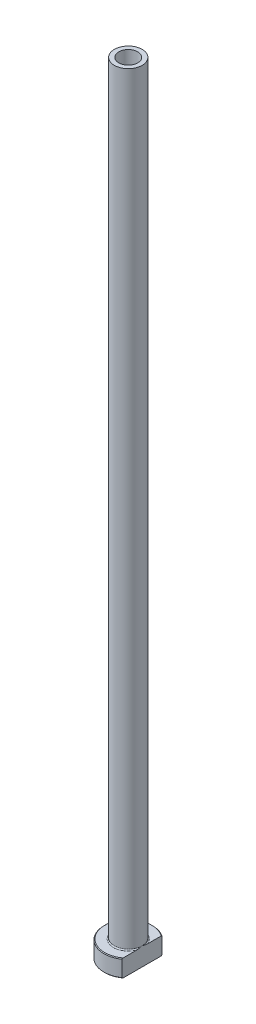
ISO-10303-21;
HEADER;
FILE_DESCRIPTION(('STEP AP214'),'2;1');
FILE_NAME('part.step','',(''),(''),'','','');
FILE_SCHEMA(('AUTOMOTIVE_DESIGN { 1 0 10303 214 1 1 1 1 }'));
ENDSEC;
DATA;
#1=APPLICATION_CONTEXT('core data for automotive mechanical design processes');
#2=APPLICATION_PROTOCOL_DEFINITION('international standard','automotive_design',2000,#1);
#3=PRODUCT_CONTEXT('',#1,'mechanical');
#4=PRODUCT('Part','Part','',(#3));
#5=PRODUCT_RELATED_PRODUCT_CATEGORY('part','',(#4));
#6=PRODUCT_DEFINITION_FORMATION('','',#4);
#7=PRODUCT_DEFINITION_CONTEXT('part definition',#1,'design');
#8=PRODUCT_DEFINITION('design','',#6,#7);
#9=PRODUCT_DEFINITION_SHAPE('','',#8);
#10=(LENGTH_UNIT() NAMED_UNIT(*) SI_UNIT(.MILLI.,.METRE.));
#11=(NAMED_UNIT(*) PLANE_ANGLE_UNIT() SI_UNIT($,.RADIAN.));
#12=(NAMED_UNIT(*) SI_UNIT($,.STERADIAN.) SOLID_ANGLE_UNIT());
#13=UNCERTAINTY_MEASURE_WITH_UNIT(LENGTH_MEASURE(1.E-05),#10,'distance_accuracy_value','');
#14=(GEOMETRIC_REPRESENTATION_CONTEXT(3) GLOBAL_UNCERTAINTY_ASSIGNED_CONTEXT((#13)) GLOBAL_UNIT_ASSIGNED_CONTEXT((#10,
#11,#12)) REPRESENTATION_CONTEXT('',''));
#15=CARTESIAN_POINT('',(0.,0.,0.));
#16=DIRECTION('',(0.,0.,1.));
#17=DIRECTION('',(1.,0.,0.));
#18=AXIS2_PLACEMENT_3D('',#15,#16,#17);
#19=CARTESIAN_POINT('',(0.,92.1876809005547,0.));
#20=DIRECTION('',(0.,1.,0.));
#21=DIRECTION('',(0.,0.,1.));
#22=AXIS2_PLACEMENT_3D('',#19,#20,#21);
#23=CYLINDRICAL_SURFACE('',#22,2.75000000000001);
#24=CARTESIAN_POINT('',(0.,225.,0.));
#25=DIRECTION('',(0.,1.,0.));
#26=DIRECTION('',(0.,0.,1.));
#27=AXIS2_PLACEMENT_3D('',#24,#25,#26);
#28=CIRCLE('',#27,2.75000000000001);
#29=CARTESIAN_POINT('',(0.,225.,2.75000000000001));
#30=VERTEX_POINT('',#29);
#31=EDGE_CURVE('E167',#30,#30,#28,.T.);
#32=ORIENTED_EDGE('',*,*,#31,.T.);
#33=EDGE_LOOP('',(#32));
#34=FACE_BOUND('',#33,.T.);
#35=CARTESIAN_POINT('',(0.,180.,0.));
#36=DIRECTION('',(0.,1.,0.));
#37=DIRECTION('',(0.,0.,1.));
#38=AXIS2_PLACEMENT_3D('',#35,#36,#37);
#39=CIRCLE('',#38,2.75000000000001);
#40=CARTESIAN_POINT('',(0.,180.,2.75000000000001));
#41=VERTEX_POINT('',#40);
#42=EDGE_CURVE('E170',#41,#41,#39,.T.);
#43=ORIENTED_EDGE('',*,*,#42,.F.);
#44=EDGE_LOOP('',(#43));
#45=FACE_BOUND('',#44,.T.);
#46=ADVANCED_FACE('F32',(#34,#45),#23,.F.);
#47=CARTESIAN_POINT('',(-2.75000000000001,225.,0.));
#48=DIRECTION('',(0.,1.,0.));
#49=DIRECTION('',(0.,0.,1.));
#50=AXIS2_PLACEMENT_3D('',#47,#48,#49);
#51=PLANE('',#50);
#52=CARTESIAN_POINT('',(0.,225.,0.));
#53=DIRECTION('',(0.,1.,0.));
#54=DIRECTION('',(0.,0.,1.));
#55=AXIS2_PLACEMENT_3D('',#52,#53,#54);
#56=CIRCLE('',#55,4.00000000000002);
#57=CARTESIAN_POINT('',(0.,225.,4.00000000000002));
#58=VERTEX_POINT('',#57);
#59=EDGE_CURVE('E174',#58,#58,#56,.T.);
#60=ORIENTED_EDGE('',*,*,#59,.T.);
#61=EDGE_LOOP('',(#60));
#62=FACE_BOUND('',#61,.T.);
#63=ORIENTED_EDGE('',*,*,#31,.F.);
#64=EDGE_LOOP('',(#63));
#65=FACE_BOUND('',#64,.T.);
#66=ADVANCED_FACE('F157',(#62,#65),#51,.T.);
#67=CARTESIAN_POINT('',(0.,92.1876809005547,0.));
#68=DIRECTION('',(0.,1.,0.));
#69=DIRECTION('',(0.,0.,1.));
#70=AXIS2_PLACEMENT_3D('',#67,#68,#69);
#71=CYLINDRICAL_SURFACE('',#70,4.);
#72=CARTESIAN_POINT('',(0.,5.3,0.));
#73=DIRECTION('',(0.,1.,0.));
#74=DIRECTION('',(0.,0.,1.));
#75=AXIS2_PLACEMENT_3D('',#72,#73,#74);
#76=CIRCLE('',#75,4.);
#77=CARTESIAN_POINT('',(4.,5.3,0.));
#78=VERTEX_POINT('',#77);
#79=EDGE_CURVE('E180',#78,#78,#76,.T.);
#80=ORIENTED_EDGE('',*,*,#79,.T.);
#81=EDGE_LOOP('',(#80));
#82=FACE_BOUND('',#81,.T.);
#83=ORIENTED_EDGE('',*,*,#59,.F.);
#84=EDGE_LOOP('',(#83));
#85=FACE_BOUND('',#84,.T.);
#86=ADVANCED_FACE('F162',(#82,#85),#71,.T.);
#87=CARTESIAN_POINT('',(-3.99999999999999,5.,0.));
#88=DIRECTION('',(0.,1.,0.));
#89=DIRECTION('',(0.,0.,1.));
#90=AXIS2_PLACEMENT_3D('',#87,#88,#89);
#91=PLANE('',#90);
#92=DIRECTION('',(0.,0.,1.));
#93=VECTOR('',#92,1.);
#94=CARTESIAN_POINT('',(4.,5.,0.));
#95=LINE('',#94,#93);
#96=CARTESIAN_POINT('',(4.,5.,-5.49909083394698));
#97=VERTEX_POINT('',#96);
#98=CARTESIAN_POINT('',(4.,5.,-1.57797338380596));
#99=VERTEX_POINT('',#98);
#100=EDGE_CURVE('E54',#97,#99,#95,.T.);
#101=ORIENTED_EDGE('',*,*,#100,.F.);
#102=CARTESIAN_POINT('',(0.,5.,0.));
#103=DIRECTION('',(0.,1.,0.));
#104=DIRECTION('',(0.,0.,1.));
#105=AXIS2_PLACEMENT_3D('',#102,#103,#104);
#106=CIRCLE('',#105,6.79999999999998);
#107=CARTESIAN_POINT('',(3.99999999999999,5.,5.49909083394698));
#108=VERTEX_POINT('',#107);
#109=EDGE_CURVE('E186',#97,#108,#106,.T.);
#110=ORIENTED_EDGE('',*,*,#109,.T.);
#111=CARTESIAN_POINT('',(4.,5.,1.57797338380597));
#112=VERTEX_POINT('',#111);
#113=EDGE_CURVE('E134',#112,#108,#95,.T.);
#114=ORIENTED_EDGE('',*,*,#113,.F.);
#115=CARTESIAN_POINT('',(0.,5.,0.));
#116=DIRECTION('',(0.,1.,0.));
#117=DIRECTION('',(0.,0.,1.));
#118=AXIS2_PLACEMENT_3D('',#115,#116,#117);
#119=CIRCLE('',#118,4.3);
#120=EDGE_CURVE('E183',#112,#99,#119,.F.);
#121=ORIENTED_EDGE('',*,*,#120,.T.);
#122=EDGE_LOOP('',(#101,#110,#114,#121));
#123=FACE_BOUND('',#122,.T.);
#124=ADVANCED_FACE('F197',(#123),#91,.T.);
#125=CARTESIAN_POINT('',(0.,92.1876809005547,0.));
#126=DIRECTION('',(0.,1.,0.));
#127=DIRECTION('',(0.,0.,1.));
#128=AXIS2_PLACEMENT_3D('',#125,#126,#127);
#129=CYLINDRICAL_SURFACE('',#128,6.99999999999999);
#130=DIRECTION('',(0.,-1.,0.));
#131=VECTOR('',#130,1.);
#132=CARTESIAN_POINT('',(3.99999999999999,225.,5.74456264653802));
#133=LINE('',#132,#131);
#134=CARTESIAN_POINT('',(3.99999999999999,4.79999999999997,5.74456264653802));
#135=VERTEX_POINT('',#134);
#136=CARTESIAN_POINT('',(3.99999999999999,0.20000000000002,5.74456264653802));
#137=VERTEX_POINT('',#136);
#138=EDGE_CURVE('E82',#135,#137,#133,.T.);
#139=ORIENTED_EDGE('',*,*,#138,.F.);
#140=CARTESIAN_POINT('',(0.,4.79999999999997,0.));
#141=DIRECTION('',(0.,1.,0.));
#142=DIRECTION('',(0.,0.,1.));
#143=AXIS2_PLACEMENT_3D('',#140,#141,#142);
#144=CIRCLE('',#143,6.99999999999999);
#145=CARTESIAN_POINT('',(4.,4.79999999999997,-5.74456264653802));
#146=VERTEX_POINT('',#145);
#147=EDGE_CURVE('E95',#135,#146,#144,.F.);
#148=ORIENTED_EDGE('',*,*,#147,.T.);
#149=DIRECTION('',(0.,-1.,0.));
#150=VECTOR('',#149,1.);
#151=CARTESIAN_POINT('',(4.,225.,-5.74456264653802));
#152=LINE('',#151,#150);
#153=CARTESIAN_POINT('',(4.,0.20000000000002,-5.74456264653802));
#154=VERTEX_POINT('',#153);
#155=EDGE_CURVE('E192',#146,#154,#152,.T.);
#156=ORIENTED_EDGE('',*,*,#155,.T.);
#157=CARTESIAN_POINT('',(0.,0.20000000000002,0.));
#158=DIRECTION('',(0.,-1.,0.));
#159=DIRECTION('',(0.,0.,-1.));
#160=AXIS2_PLACEMENT_3D('',#157,#158,#159);
#161=CIRCLE('',#160,6.99999999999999);
#162=EDGE_CURVE('E98',#154,#137,#161,.F.);
#163=ORIENTED_EDGE('',*,*,#162,.T.);
#164=EDGE_LOOP('',(#139,#148,#156,#163));
#165=FACE_BOUND('',#164,.T.);
#166=ADVANCED_FACE('F190',(#165),#129,.T.);
#167=CARTESIAN_POINT('',(-6.99999999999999,0.,0.));
#168=DIRECTION('',(0.,-1.,0.));
#169=DIRECTION('',(0.,0.,-1.));
#170=AXIS2_PLACEMENT_3D('',#167,#168,#169);
#171=PLANE('',#170);
#172=CARTESIAN_POINT('',(0.,0.,0.));
#173=DIRECTION('',(0.,-1.,0.));
#174=DIRECTION('',(0.,0.,-1.));
#175=AXIS2_PLACEMENT_3D('',#172,#173,#174);
#176=CIRCLE('',#175,3.50000000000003);
#177=CARTESIAN_POINT('',(0.,0.,-3.50000000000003));
#178=VERTEX_POINT('',#177);
#179=EDGE_CURVE('E40',#178,#178,#176,.F.);
#180=ORIENTED_EDGE('',*,*,#179,.T.);
#181=EDGE_LOOP('',(#180));
#182=FACE_BOUND('',#181,.T.);
#183=DIRECTION('',(0.,0.,-1.));
#184=VECTOR('',#183,1.);
#185=CARTESIAN_POINT('',(3.99999999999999,0.,5.74456264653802));
#186=LINE('',#185,#184);
#187=CARTESIAN_POINT('',(3.99999999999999,0.,5.49909083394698));
#188=VERTEX_POINT('',#187);
#189=CARTESIAN_POINT('',(4.,0.,-5.49909083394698));
#190=VERTEX_POINT('',#189);
#191=EDGE_CURVE('E47',#188,#190,#186,.T.);
#192=ORIENTED_EDGE('',*,*,#191,.F.);
#193=CARTESIAN_POINT('',(0.,0.,0.));
#194=DIRECTION('',(0.,-1.,0.));
#195=DIRECTION('',(0.,0.,-1.));
#196=AXIS2_PLACEMENT_3D('',#193,#194,#195);
#197=CIRCLE('',#196,6.79999999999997);
#198=EDGE_CURVE('E92',#188,#190,#197,.T.);
#199=ORIENTED_EDGE('',*,*,#198,.T.);
#200=EDGE_LOOP('',(#192,#199));
#201=FACE_BOUND('',#200,.T.);
#202=ADVANCED_FACE('F91',(#182,#201),#171,.T.);
#203=CARTESIAN_POINT('',(0.,92.1876809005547,0.));
#204=DIRECTION('',(0.,1.,0.));
#205=DIRECTION('',(0.,0.,1.));
#206=AXIS2_PLACEMENT_3D('',#203,#204,#205);
#207=CYLINDRICAL_SURFACE('',#206,3.);
#208=CARTESIAN_POINT('',(0.,0.500000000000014,0.));
#209=DIRECTION('',(0.,-1.,0.));
#210=DIRECTION('',(0.,0.,-1.));
#211=AXIS2_PLACEMENT_3D('',#208,#209,#210);
#212=CIRCLE('',#211,3.);
#213=CARTESIAN_POINT('',(0.,0.500000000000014,-3.));
#214=VERTEX_POINT('',#213);
#215=EDGE_CURVE('E11',#214,#214,#212,.T.);
#216=ORIENTED_EDGE('',*,*,#215,.T.);
#217=EDGE_LOOP('',(#216));
#218=FACE_BOUND('',#217,.T.);
#219=CARTESIAN_POINT('',(0.,168.,0.));
#220=DIRECTION('',(0.,1.,0.));
#221=DIRECTION('',(0.,0.,1.));
#222=AXIS2_PLACEMENT_3D('',#219,#220,#221);
#223=CIRCLE('',#222,3.00000000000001);
#224=CARTESIAN_POINT('',(0.,168.,3.00000000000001));
#225=VERTEX_POINT('',#224);
#226=EDGE_CURVE('E172',#225,#225,#223,.T.);
#227=ORIENTED_EDGE('',*,*,#226,.T.);
#228=EDGE_LOOP('',(#227));
#229=FACE_BOUND('',#228,.T.);
#230=ADVANCED_FACE('F215',(#218,#229),#207,.F.);
#231=CARTESIAN_POINT('',(0.,168.,0.));
#232=DIRECTION('',(0.,-1.,0.));
#233=DIRECTION('',(0.,0.,-1.));
#234=AXIS2_PLACEMENT_3D('',#231,#232,#233);
#235=CONICAL_SURFACE('',#234,3.00000000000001,0.0208303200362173);
#236=ORIENTED_EDGE('',*,*,#42,.T.);
#237=EDGE_LOOP('',(#236));
#238=FACE_BOUND('',#237,.T.);
#239=ORIENTED_EDGE('',*,*,#226,.F.);
#240=EDGE_LOOP('',(#239));
#241=FACE_BOUND('',#240,.T.);
#242=ADVANCED_FACE('F111',(#238,#241),#235,.F.);
#243=CARTESIAN_POINT('',(0.,5.3,0.));
#244=DIRECTION('',(0.,1.,0.));
#245=DIRECTION('',(0.,0.,1.));
#246=AXIS2_PLACEMENT_3D('',#243,#244,#245);
#247=TOROIDAL_SURFACE('',#246,4.3,0.3);
#248=ORIENTED_EDGE('',*,*,#120,.F.);
#249=CARTESIAN_POINT('',(4.,5.3,0.));
#250=CARTESIAN_POINT('',(4.,5.3000006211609,-1.06261402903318E-10));
#251=CARTESIAN_POINT('',(4.,5.30000124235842,2.17726115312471E-07));
#252=CARTESIAN_POINT('',(4.,5.30000240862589,8.3614111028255E-07));
#253=CARTESIAN_POINT('',(4.,5.30000294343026,1.25011693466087E-06));
#254=CARTESIAN_POINT('',(4.,5.30000404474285,2.23959355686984E-06));
#255=CARTESIAN_POINT('',(4.,5.30000459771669,2.83084484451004E-06));
#256=CARTESIAN_POINT('',(4.,5.30000559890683,4.06516628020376E-06));
#257=CARTESIAN_POINT('',(4.,5.30000604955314,4.70640106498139E-06));
#258=CARTESIAN_POINT('',(4.,5.30000769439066,7.15677247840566E-06));
#259=CARTESIAN_POINT('',(4.,5.30000879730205,9.02996026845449E-06));
#260=CARTESIAN_POINT('',(4.,5.30001063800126,1.27664892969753E-05));
#261=CARTESIAN_POINT('',(4.,5.30001139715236,1.46197811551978E-05));
#262=CARTESIAN_POINT('',(4.,5.30001453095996,2.23679231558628E-05));
#263=CARTESIAN_POINT('',(4.,5.30001683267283,2.829687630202E-05));
#264=CARTESIAN_POINT('',(4.,5.30002027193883,3.95668745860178E-05));
#265=CARTESIAN_POINT('',(4.,5.30002152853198,4.487154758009E-05));
#266=CARTESIAN_POINT('',(4.,5.3000306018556,8.40118223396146E-05));
#267=CARTESIAN_POINT('',(4.,5.30003739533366,0.00011802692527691));
#268=CARTESIAN_POINT('',(3.99999999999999,5.30006713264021,0.000252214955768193));
#269=CARTESIAN_POINT('',(3.99999999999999,5.30009559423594,0.000351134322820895));
#270=CARTESIAN_POINT('',(4.,5.30020622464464,0.000742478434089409));
#271=CARTESIAN_POINT('',(4.,5.30028475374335,0.00103561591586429));
#272=CARTESIAN_POINT('',(3.99999999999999,5.30059889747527,0.00219920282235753));
#273=CARTESIAN_POINT('',(3.99999999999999,5.30083905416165,0.00306873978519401));
#274=CARTESIAN_POINT('',(4.,5.30183682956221,0.00669141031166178));
#275=CARTESIAN_POINT('',(4.,5.30258877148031,0.0094456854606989));
#276=CARTESIAN_POINT('',(3.99999999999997,5.31066890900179,0.0390293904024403));
#277=CARTESIAN_POINT('',(3.99999999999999,5.31802631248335,0.0658531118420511));
#278=CARTESIAN_POINT('',(4.,5.33239676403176,0.11844192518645));
#279=CARTESIAN_POINT('',(4.,5.33941183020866,0.144206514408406));
#280=CARTESIAN_POINT('',(3.99999999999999,5.35427366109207,0.199017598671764));
#281=CARTESIAN_POINT('',(3.99999999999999,5.362113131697,0.228066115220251));
#282=CARTESIAN_POINT('',(4.,5.37776349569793,0.286511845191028));
#283=CARTESIAN_POINT('',(4.,5.38557313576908,0.31590939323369));
#284=CARTESIAN_POINT('',(4.,5.40425662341,0.386994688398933));
#285=CARTESIAN_POINT('',(4.,5.4150523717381,0.4287031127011));
#286=CARTESIAN_POINT('',(4.,5.43592310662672,0.511098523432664));
#287=CARTESIAN_POINT('',(4.,5.44600969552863,0.551782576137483));
#288=CARTESIAN_POINT('',(4.,5.47850986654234,0.686599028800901));
#289=CARTESIAN_POINT('',(4.,5.49978370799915,0.781011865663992));
#290=CARTESIAN_POINT('',(4.,5.53807543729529,0.971847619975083));
#291=CARTESIAN_POINT('',(4.,5.55504273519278,1.06828120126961));
#292=CARTESIAN_POINT('',(4.,5.57582405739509,1.21752725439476));
#293=CARTESIAN_POINT('',(4.,5.5820979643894,1.26999379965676));
#294=CARTESIAN_POINT('',(4.,5.59210686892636,1.37516324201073));
#295=CARTESIAN_POINT('',(4.,5.59584265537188,1.42786606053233));
#296=CARTESIAN_POINT('',(4.,5.60010438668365,1.53310673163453));
#297=CARTESIAN_POINT('',(4.,5.6006487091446,1.58564378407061));
#298=CARTESIAN_POINT('',(4.,5.59767158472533,1.69058605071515));
#299=CARTESIAN_POINT('',(4.,5.59415502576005,1.74299134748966));
#300=CARTESIAN_POINT('',(4.,5.58503062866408,1.81903290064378));
#301=CARTESIAN_POINT('',(4.,5.58157617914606,1.84292934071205));
#302=CARTESIAN_POINT('',(4.,5.57329952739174,1.89051061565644));
#303=CARTESIAN_POINT('',(4.,5.56847619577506,1.91419525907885));
#304=CARTESIAN_POINT('',(4.,5.55726644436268,1.96092888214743));
#305=CARTESIAN_POINT('',(4.,5.55089740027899,1.98398195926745));
#306=CARTESIAN_POINT('',(4.,5.53623434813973,2.02945550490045));
#307=CARTESIAN_POINT('',(4.,5.52794253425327,2.05187666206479));
#308=CARTESIAN_POINT('',(4.,5.50887098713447,2.09590631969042));
#309=CARTESIAN_POINT('',(4.,5.49806837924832,2.11750508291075));
#310=CARTESIAN_POINT('',(4.,5.47333401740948,2.15885583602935));
#311=CARTESIAN_POINT('',(4.,5.45941272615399,2.17861369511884));
#312=CARTESIAN_POINT('',(4.,5.43588221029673,2.20522942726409));
#313=CARTESIAN_POINT('',(4.,5.42781139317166,2.21344043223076));
#314=CARTESIAN_POINT('',(4.,5.41065114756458,2.22875149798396));
#315=CARTESIAN_POINT('',(4.,5.4015612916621,2.23585108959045));
#316=CARTESIAN_POINT('',(4.,5.38220524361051,2.24859694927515));
#317=CARTESIAN_POINT('',(4.,5.37192420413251,2.25422119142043));
#318=CARTESIAN_POINT('',(4.,5.3504507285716,2.26331064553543));
#319=CARTESIAN_POINT('',(4.,5.33926122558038,2.26678251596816));
#320=CARTESIAN_POINT('',(4.,5.31952044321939,2.2705126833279));
#321=CARTESIAN_POINT('',(4.,5.31108453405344,2.27139016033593));
#322=CARTESIAN_POINT('',(4.,5.29418624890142,2.27168963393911));
#323=CARTESIAN_POINT('',(4.,5.2857238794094,2.27111196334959));
#324=CARTESIAN_POINT('',(4.,5.269041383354,2.26855580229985));
#325=CARTESIAN_POINT('',(4.,5.26082066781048,2.26658107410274));
#326=CARTESIAN_POINT('',(4.,5.24478214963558,2.26139496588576));
#327=CARTESIAN_POINT('',(4.,5.23696461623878,2.25818277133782));
#328=CARTESIAN_POINT('',(4.,5.2185123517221,2.24908332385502));
#329=CARTESIAN_POINT('',(4.,5.20815219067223,2.24264095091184));
#330=CARTESIAN_POINT('',(4.,5.18857975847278,2.22819957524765));
#331=CARTESIAN_POINT('',(4.,5.17937061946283,2.22019647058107));
#332=CARTESIAN_POINT('',(4.,5.15665383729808,2.19777756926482));
#333=CARTESIAN_POINT('',(4.,5.14403484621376,2.18246908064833));
#334=CARTESIAN_POINT('',(4.,5.12118369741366,2.15020843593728));
#335=CARTESIAN_POINT('',(4.,5.11095480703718,2.13325407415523));
#336=CARTESIAN_POINT('',(4.,5.09273574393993,2.09892324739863));
#337=CARTESIAN_POINT('',(4.,5.08468212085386,2.0815798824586));
#338=CARTESIAN_POINT('',(4.,5.07005901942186,2.04627072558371));
#339=CARTESIAN_POINT('',(4.,5.06349101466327,2.02830433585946));
#340=CARTESIAN_POINT('',(4.,5.04555485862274,1.97350761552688));
#341=CARTESIAN_POINT('',(4.,5.0360897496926,1.93605770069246));
#342=CARTESIAN_POINT('',(4.,5.01780569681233,1.84529235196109));
#343=CARTESIAN_POINT('',(4.,5.01077018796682,1.79164082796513));
#344=CARTESIAN_POINT('',(4.,5.00182846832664,1.68379947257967));
#345=CARTESIAN_POINT('',(4.,4.99993887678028,1.62960846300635));
#346=CARTESIAN_POINT('',(4.,5.00006129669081,1.52361204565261));
#347=CARTESIAN_POINT('',(4.,5.00190698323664,1.47180551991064));
#348=CARTESIAN_POINT('',(4.,5.00841243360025,1.36835357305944));
#349=CARTESIAN_POINT('',(4.,5.01307376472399,1.31670825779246));
#350=CARTESIAN_POINT('',(4.,5.02905484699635,1.17431887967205));
#351=CARTESIAN_POINT('',(4.,5.04274090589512,1.08384207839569));
#352=CARTESIAN_POINT('',(4.,5.06701714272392,0.947757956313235));
#353=CARTESIAN_POINT('',(4.,5.07585573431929,0.901814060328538));
#354=CARTESIAN_POINT('',(4.,5.09458665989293,0.810008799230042));
#355=CARTESIAN_POINT('',(4.,5.1044818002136,0.76414800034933));
#356=CARTESIAN_POINT('',(4.,5.12892434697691,0.655631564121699));
#357=CARTESIAN_POINT('',(4.,5.14383556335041,0.593058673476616));
#358=CARTESIAN_POINT('',(3.99999999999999,5.17458762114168,0.468885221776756));
#359=CARTESIAN_POINT('',(3.99999999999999,5.19041623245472,0.407281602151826));
#360=CARTESIAN_POINT('',(4.,5.22090834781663,0.291232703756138));
#361=CARTESIAN_POINT('',(4.00000000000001,5.23550024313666,0.236768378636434));
#362=CARTESIAN_POINT('',(3.99999999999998,5.26562550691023,0.125604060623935));
#363=CARTESIAN_POINT('',(3.99999999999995,5.28117250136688,0.0689076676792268));
#364=CARTESIAN_POINT('',(4.,5.29741226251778,0.00944154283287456));
#365=CARTESIAN_POINT('',(4.,5.29816540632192,0.00668315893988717));
#366=CARTESIAN_POINT('',(3.99999999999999,5.29916346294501,0.00305954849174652));
#367=CARTESIAN_POINT('',(3.99999999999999,5.29940273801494,0.00219318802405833));
#368=CARTESIAN_POINT('',(4.,5.29971580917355,0.00103357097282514));
#369=CARTESIAN_POINT('',(4.,5.29979412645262,0.000741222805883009));
#370=CARTESIAN_POINT('',(3.99999999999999,5.29990450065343,0.000350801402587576));
#371=CARTESIAN_POINT('',(3.99999999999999,5.29993292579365,0.000252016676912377));
#372=CARTESIAN_POINT('',(4.,5.29996263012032,0.000117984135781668));
#373=CARTESIAN_POINT('',(4.,5.29996941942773,8.39881915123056E-05));
#374=CARTESIAN_POINT('',(4.,5.29997848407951,4.48674025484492E-05));
#375=CARTESIAN_POINT('',(4.,5.29997973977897,3.95638200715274E-05));
#376=CARTESIAN_POINT('',(4.,5.2999831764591,2.82960347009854E-05));
#377=CARTESIAN_POINT('',(4.,5.29998547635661,2.23681462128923E-05));
#378=CARTESIAN_POINT('',(4.,5.29998860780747,1.46211004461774E-05));
#379=CARTESIAN_POINT('',(4.,5.29998936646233,1.27678902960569E-05));
#380=CARTESIAN_POINT('',(4.,5.29999120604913,9.03144078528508E-06));
#381=CARTESIAN_POINT('',(4.,5.29999230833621,7.15824106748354E-06));
#382=CARTESIAN_POINT('',(4.,5.29999395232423,4.70775534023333E-06));
#383=CARTESIAN_POINT('',(4.,5.29999440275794,4.06646398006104E-06));
#384=CARTESIAN_POINT('',(4.,5.29999540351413,2.8319910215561E-06));
#385=CARTESIAN_POINT('',(4.,5.29999595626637,2.24064356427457E-06));
#386=CARTESIAN_POINT('',(4.,5.29999705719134,1.25093982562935E-06));
#387=CARTESIAN_POINT('',(4.,5.29999759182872,8.36841164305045E-07));
#388=CARTESIAN_POINT('',(4.,5.29999875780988,2.18117796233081E-07));
#389=CARTESIAN_POINT('',(4.,5.29999937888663,1.06254479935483E-10));
#390=CARTESIAN_POINT('',(4.,5.3,0.));
#391=B_SPLINE_CURVE_WITH_KNOTS('',3,(#249,#250,#251,#252,#253,#254,#255,#256,#257,#258,#259,
#260,#261,#262,#263,#264,#265,#266,#267,#268,#269,#270,#271,#272,#273,#274,#275,#276,#277,#278,
#279,#280,#281,#282,#283,#284,#285,#286,#287,#288,#289,#290,#291,#292,#293,#294,#295,#296,#297,
#298,#299,#300,#301,#302,#303,#304,#305,#306,#307,#308,#309,#310,#311,#312,#313,#314,#315,#316,
#317,#318,#319,#320,#321,#322,#323,#324,#325,#326,#327,#328,#329,#330,#331,#332,#333,#334,#335,
#336,#337,#338,#339,#340,#341,#342,#343,#344,#345,#346,#347,#348,#349,#350,#351,#352,#353,#354,
#355,#356,#357,#358,#359,#360,#361,#362,#363,#364,#365,#366,#367,#368,#369,#370,#371,#372,#373,
#374,#375,#376,#377,#378,#379,#380,#381,#382,#383,#384,#385,#386,#387,#388,#389,#390),
.UNSPECIFIED.,.T.,.F.,(4,2,2,2,2,2,2,2,2,2,2,2,2,2,2,2,2,2,2,2,2,2,2,2,2,2,2,2,2,2,2,2,2,2,2,2,
2,2,2,2,2,2,2,2,2,2,2,2,2,2,2,2,2,2,2,2,2,2,2,2,2,2,2,2,2,2,2,2,2,2,4),(0.,1.87484377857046E-06,
3.90179959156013E-06,6.31683762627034E-06,8.66651882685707E-06,1.51627545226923E-05,
2.11657921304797E-05,4.02090766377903E-05,5.65429458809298E-05,0.000160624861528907,
0.000469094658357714,0.00137985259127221,0.00408571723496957,0.012651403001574,
0.0960918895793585,0.17620014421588,0.266463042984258,0.357714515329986,0.486961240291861,
0.612707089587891,0.90298810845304,1.19653589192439,1.35501075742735,1.51343634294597,
1.67094875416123,1.82827177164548,1.90067591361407,1.97313996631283,2.04482437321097,
2.11642737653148,2.18871023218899,2.26075412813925,2.29521947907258,2.3296993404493,
2.36466792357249,2.39952778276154,2.42485422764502,2.45017488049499,2.47542760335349,
2.50069697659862,2.53708899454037,2.57357798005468,2.63276032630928,2.69202310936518,
2.74930315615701,2.80663977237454,2.92223125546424,3.08420752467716,3.24670629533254,
3.40212850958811,3.5576373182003,3.83192962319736,3.97228382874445,4.11302057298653,
4.3059813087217,4.49678885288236,4.66594443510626,4.84230602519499,4.85088453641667,
4.85358051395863,4.85448881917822,4.85479687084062,4.85490089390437,4.8549172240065,
4.85493626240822,4.85494226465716,4.85494875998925,4.85495110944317,4.85495352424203,
4.85495555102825,4.85495742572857),.UNSPECIFIED.);
#392=EDGE_CURVE('E126',#112,#78,#391,.T.);
#393=ORIENTED_EDGE('',*,*,#392,.T.);
#394=ORIENTED_EDGE('',*,*,#79,.F.);
#395=CARTESIAN_POINT('',(4.,5.3,0.));
#396=CARTESIAN_POINT('',(4.,5.2999993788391,1.06262606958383E-10));
#397=CARTESIAN_POINT('',(4.,5.29999875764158,-2.17726114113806E-07));
#398=CARTESIAN_POINT('',(4.,5.29999759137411,-8.36141109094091E-07));
#399=CARTESIAN_POINT('',(4.,5.29999705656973,-1.25011693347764E-06));
#400=CARTESIAN_POINT('',(4.,5.29999595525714,-2.23959355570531E-06));
#401=CARTESIAN_POINT('',(4.,5.29999540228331,-2.8308448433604E-06));
#402=CARTESIAN_POINT('',(4.,5.29999440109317,-4.06516627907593E-06));
#403=CARTESIAN_POINT('',(4.,5.29999395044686,-4.70640106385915E-06));
#404=CARTESIAN_POINT('',(4.,5.29999230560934,-7.15677247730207E-06));
#405=CARTESIAN_POINT('',(4.,5.29999120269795,-9.02996026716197E-06));
#406=CARTESIAN_POINT('',(4.,5.29998936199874,-1.27664892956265E-05));
#407=CARTESIAN_POINT('',(4.,5.29998860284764,-1.4619781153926E-05));
#408=CARTESIAN_POINT('',(4.,5.29998546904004,-2.2367923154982E-05));
#409=CARTESIAN_POINT('',(4.,5.29998316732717,-2.8296876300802E-05));
#410=CARTESIAN_POINT('',(4.,5.29997972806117,-3.95668745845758E-05));
#411=CARTESIAN_POINT('',(4.,5.29997847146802,-4.48715475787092E-05));
#412=CARTESIAN_POINT('',(4.,5.2999693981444,-8.40118223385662E-05));
#413=CARTESIAN_POINT('',(4.,5.29996260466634,-0.000118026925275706));
#414=CARTESIAN_POINT('',(3.99999999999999,5.29993286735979,-0.000252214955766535));
#415=CARTESIAN_POINT('',(3.99999999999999,5.29990440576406,-0.000351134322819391));
#416=CARTESIAN_POINT('',(4.,5.29979377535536,-0.000742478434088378));
#417=CARTESIAN_POINT('',(4.,5.29971524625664,-0.00103561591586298));
#418=CARTESIAN_POINT('',(3.99999999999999,5.29940110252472,-0.00219920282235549));
#419=CARTESIAN_POINT('',(3.99999999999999,5.29916094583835,-0.00306873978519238));
#420=CARTESIAN_POINT('',(4.,5.29816317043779,-0.00669141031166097));
#421=CARTESIAN_POINT('',(4.,5.29741122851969,-0.00944568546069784));
#422=CARTESIAN_POINT('',(3.99999999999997,5.28933109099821,-0.039029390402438));
#423=CARTESIAN_POINT('',(3.99999999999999,5.28197368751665,-0.0658531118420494));
#424=CARTESIAN_POINT('',(4.,5.26760323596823,-0.118441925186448));
#425=CARTESIAN_POINT('',(4.,5.26058816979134,-0.144206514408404));
#426=CARTESIAN_POINT('',(3.99999999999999,5.24572633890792,-0.199017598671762));
#427=CARTESIAN_POINT('',(3.99999999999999,5.23788686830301,-0.228066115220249));
#428=CARTESIAN_POINT('',(4.,5.22223650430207,-0.286511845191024));
#429=CARTESIAN_POINT('',(4.,5.21442686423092,-0.315909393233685));
#430=CARTESIAN_POINT('',(4.,5.19574337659,-0.386994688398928));
#431=CARTESIAN_POINT('',(4.,5.1849476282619,-0.428703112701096));
#432=CARTESIAN_POINT('',(4.,5.16407689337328,-0.511098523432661));
#433=CARTESIAN_POINT('',(4.,5.15399030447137,-0.551782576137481));
#434=CARTESIAN_POINT('',(4.,5.12149013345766,-0.686599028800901));
#435=CARTESIAN_POINT('',(4.,5.10021629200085,-0.781011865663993));
#436=CARTESIAN_POINT('',(4.,5.06192456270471,-0.971847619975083));
#437=CARTESIAN_POINT('',(4.,5.04495726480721,-1.06828120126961));
#438=CARTESIAN_POINT('',(4.,5.02417594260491,-1.21752725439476));
#439=CARTESIAN_POINT('',(4.,5.0179020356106,-1.26999379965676));
#440=CARTESIAN_POINT('',(4.,5.00789313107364,-1.37516324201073));
#441=CARTESIAN_POINT('',(4.,5.00415734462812,-1.42786606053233));
#442=CARTESIAN_POINT('',(4.,4.99989561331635,-1.53310673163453));
#443=CARTESIAN_POINT('',(4.,4.9993512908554,-1.58564378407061));
#444=CARTESIAN_POINT('',(4.,5.00232841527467,-1.69058605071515));
#445=CARTESIAN_POINT('',(4.,5.00584497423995,-1.74299134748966));
#446=CARTESIAN_POINT('',(4.,5.01496937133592,-1.81903290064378));
#447=CARTESIAN_POINT('',(4.,5.01842382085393,-1.84292934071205));
#448=CARTESIAN_POINT('',(4.,5.02670047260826,-1.89051061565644));
#449=CARTESIAN_POINT('',(4.,5.03152380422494,-1.91419525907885));
#450=CARTESIAN_POINT('',(4.,5.04273355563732,-1.96092888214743));
#451=CARTESIAN_POINT('',(4.,5.049102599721,-1.98398195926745));
#452=CARTESIAN_POINT('',(4.,5.06376565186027,-2.02945550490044));
#453=CARTESIAN_POINT('',(4.,5.07205746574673,-2.05187666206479));
#454=CARTESIAN_POINT('',(4.,5.09112901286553,-2.09590631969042));
#455=CARTESIAN_POINT('',(4.,5.10193162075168,-2.11750508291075));
#456=CARTESIAN_POINT('',(4.,5.12666598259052,-2.15885583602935));
#457=CARTESIAN_POINT('',(4.,5.14058727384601,-2.17861369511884));
#458=CARTESIAN_POINT('',(4.,5.16411778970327,-2.20522942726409));
#459=CARTESIAN_POINT('',(4.,5.17218860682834,-2.21344043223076));
#460=CARTESIAN_POINT('',(4.,5.18934885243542,-2.22875149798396));
#461=CARTESIAN_POINT('',(4.,5.1984387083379,-2.23585108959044));
#462=CARTESIAN_POINT('',(4.,5.21779475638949,-2.24859694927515));
#463=CARTESIAN_POINT('',(4.,5.22807579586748,-2.25422119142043));
#464=CARTESIAN_POINT('',(4.,5.24954927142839,-2.26331064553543));
#465=CARTESIAN_POINT('',(4.,5.26073877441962,-2.26678251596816));
#466=CARTESIAN_POINT('',(4.,5.2804795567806,-2.2705126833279));
#467=CARTESIAN_POINT('',(4.,5.28891546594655,-2.27139016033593));
#468=CARTESIAN_POINT('',(4.,5.30581375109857,-2.27168963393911));
#469=CARTESIAN_POINT('',(4.,5.3142761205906,-2.27111196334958));
#470=CARTESIAN_POINT('',(4.,5.330958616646,-2.26855580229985));
#471=CARTESIAN_POINT('',(4.,5.33917933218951,-2.26658107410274));
#472=CARTESIAN_POINT('',(4.,5.35521785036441,-2.26139496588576));
#473=CARTESIAN_POINT('',(4.,5.36303538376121,-2.25818277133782));
#474=CARTESIAN_POINT('',(4.,5.3814876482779,-2.24908332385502));
#475=CARTESIAN_POINT('',(4.,5.39184780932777,-2.24264095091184));
#476=CARTESIAN_POINT('',(4.,5.41142024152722,-2.22819957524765));
#477=CARTESIAN_POINT('',(4.,5.42062938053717,-2.22019647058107));
#478=CARTESIAN_POINT('',(4.,5.44334616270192,-2.19777756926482));
#479=CARTESIAN_POINT('',(4.,5.45596515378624,-2.18246908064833));
#480=CARTESIAN_POINT('',(4.,5.47881630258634,-2.15020843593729));
#481=CARTESIAN_POINT('',(4.,5.48904519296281,-2.13325407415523));
#482=CARTESIAN_POINT('',(4.,5.50726425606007,-2.09892324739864));
#483=CARTESIAN_POINT('',(4.,5.51531787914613,-2.0815798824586));
#484=CARTESIAN_POINT('',(4.,5.52994098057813,-2.04627072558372));
#485=CARTESIAN_POINT('',(4.,5.53650898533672,-2.02830433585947));
#486=CARTESIAN_POINT('',(4.,5.55444514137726,-1.97350761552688));
#487=CARTESIAN_POINT('',(4.,5.5639102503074,-1.93605770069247));
#488=CARTESIAN_POINT('',(4.,5.58219430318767,-1.8452923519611));
#489=CARTESIAN_POINT('',(4.,5.58922981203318,-1.79164082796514));
#490=CARTESIAN_POINT('',(4.,5.59817153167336,-1.68379947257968));
#491=CARTESIAN_POINT('',(4.,5.60006112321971,-1.62960846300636));
#492=CARTESIAN_POINT('',(4.,5.59993870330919,-1.52361204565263));
#493=CARTESIAN_POINT('',(4.,5.59809301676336,-1.47180551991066));
#494=CARTESIAN_POINT('',(4.,5.59158756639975,-1.36835357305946));
#495=CARTESIAN_POINT('',(4.,5.58692623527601,-1.31670825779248));
#496=CARTESIAN_POINT('',(4.,5.57094515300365,-1.17431887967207));
#497=CARTESIAN_POINT('',(4.,5.55725909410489,-1.08384207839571));
#498=CARTESIAN_POINT('',(4.,5.53298285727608,-0.947757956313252));
#499=CARTESIAN_POINT('',(4.,5.52414426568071,-0.901814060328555));
#500=CARTESIAN_POINT('',(4.,5.50541334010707,-0.810008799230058));
#501=CARTESIAN_POINT('',(4.,5.4955181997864,-0.764148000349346));
#502=CARTESIAN_POINT('',(4.,5.47107565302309,-0.655631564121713));
#503=CARTESIAN_POINT('',(4.,5.4561644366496,-0.593058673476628));
#504=CARTESIAN_POINT('',(3.99999999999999,5.42541237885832,-0.468885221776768));
#505=CARTESIAN_POINT('',(3.99999999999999,5.40958376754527,-0.407281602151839));
#506=CARTESIAN_POINT('',(4.,5.37909165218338,-0.291232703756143));
#507=CARTESIAN_POINT('',(4.00000000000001,5.36449975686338,-0.23676837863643));
#508=CARTESIAN_POINT('',(3.99999999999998,5.33437449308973,-0.125604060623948));
#509=CARTESIAN_POINT('',(3.99999999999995,5.31882749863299,-0.0689076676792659));
#510=CARTESIAN_POINT('',(4.,5.30258773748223,-0.00944154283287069));
#511=CARTESIAN_POINT('',(4.,5.30183459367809,-0.0066831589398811));
#512=CARTESIAN_POINT('',(3.99999999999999,5.30083653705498,-0.00305954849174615));
#513=CARTESIAN_POINT('',(3.99999999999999,5.30059726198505,-0.00219318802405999));
#514=CARTESIAN_POINT('',(4.,5.30028419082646,-0.0010335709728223));
#515=CARTESIAN_POINT('',(4.,5.30020587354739,-0.000741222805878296));
#516=CARTESIAN_POINT('',(3.99999999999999,5.30009549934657,-0.000350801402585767));
#517=CARTESIAN_POINT('',(3.99999999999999,5.30006707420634,-0.000252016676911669));
#518=CARTESIAN_POINT('',(4.,5.30003736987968,-0.000117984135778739));
#519=CARTESIAN_POINT('',(4.,5.30003058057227,-8.39881915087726E-05));
#520=CARTESIAN_POINT('',(4.,5.30002151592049,-4.48674025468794E-05));
#521=CARTESIAN_POINT('',(4.,5.30002026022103,-3.95638200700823E-05));
#522=CARTESIAN_POINT('',(4.,5.3000168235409,-2.82960346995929E-05));
#523=CARTESIAN_POINT('',(4.,5.30001452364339,-2.23681462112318E-05));
#524=CARTESIAN_POINT('',(4.,5.30001139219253,-1.46211004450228E-05));
#525=CARTESIAN_POINT('',(4.,5.30001063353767,-1.2767890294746E-05));
#526=CARTESIAN_POINT('',(4.,5.30000879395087,-9.03144078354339E-06));
#527=CARTESIAN_POINT('',(4.,5.30000769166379,-7.15824106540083E-06));
#528=CARTESIAN_POINT('',(4.,5.30000604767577,-4.70775533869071E-06));
#529=CARTESIAN_POINT('',(4.,5.30000559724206,-4.06646397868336E-06));
#530=CARTESIAN_POINT('',(4.,5.30000459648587,-2.83199102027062E-06));
#531=CARTESIAN_POINT('',(4.,5.30000404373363,-2.24064356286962E-06));
#532=CARTESIAN_POINT('',(4.,5.30000294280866,-1.25093982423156E-06));
#533=CARTESIAN_POINT('',(4.,5.30000240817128,-8.36841162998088E-07));
#534=CARTESIAN_POINT('',(4.,5.30000124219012,-2.18117795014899E-07));
#535=CARTESIAN_POINT('',(4.,5.30000062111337,-1.0625326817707E-10));
#536=CARTESIAN_POINT('',(4.,5.3,0.));
#537=B_SPLINE_CURVE_WITH_KNOTS('',3,(#395,#396,#397,#398,#399,#400,#401,#402,#403,#404,#405,
#406,#407,#408,#409,#410,#411,#412,#413,#414,#415,#416,#417,#418,#419,#420,#421,#422,#423,#424,
#425,#426,#427,#428,#429,#430,#431,#432,#433,#434,#435,#436,#437,#438,#439,#440,#441,#442,#443,
#444,#445,#446,#447,#448,#449,#450,#451,#452,#453,#454,#455,#456,#457,#458,#459,#460,#461,#462,
#463,#464,#465,#466,#467,#468,#469,#470,#471,#472,#473,#474,#475,#476,#477,#478,#479,#480,#481,
#482,#483,#484,#485,#486,#487,#488,#489,#490,#491,#492,#493,#494,#495,#496,#497,#498,#499,#500,
#501,#502,#503,#504,#505,#506,#507,#508,#509,#510,#511,#512,#513,#514,#515,#516,#517,#518,#519,
#520,#521,#522,#523,#524,#525,#526,#527,#528,#529,#530,#531,#532,#533,#534,#535,#536),
.UNSPECIFIED.,.T.,.F.,(4,2,2,2,2,2,2,2,2,2,2,2,2,2,2,2,2,2,2,2,2,2,2,2,2,2,2,2,2,2,2,2,2,2,2,2,
2,2,2,2,2,2,2,2,2,2,2,2,2,2,2,2,2,2,2,2,2,2,2,2,2,2,2,2,2,2,2,2,2,2,4),(0.,1.87484377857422E-06,
3.90179959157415E-06,6.31683762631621E-06,8.6665188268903E-06,1.51627545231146E-05,
2.11657921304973E-05,4.02090766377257E-05,5.65429458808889E-05,0.000160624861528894,
0.00046909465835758,0.00137985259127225,0.00408571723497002,0.012651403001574,
0.0960918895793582,0.176200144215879,0.266463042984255,0.357714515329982,0.486961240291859,
0.612707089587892,0.902988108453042,1.19653589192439,1.35501075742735,1.51343634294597,
1.67094875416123,1.82827177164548,1.90067591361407,1.97313996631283,2.04482437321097,
2.11642737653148,2.18871023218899,2.26075412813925,2.29521947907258,2.32969934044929,
2.36466792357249,2.39952778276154,2.42485422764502,2.45017488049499,2.47542760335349,
2.50069697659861,2.53708899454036,2.57357798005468,2.63276032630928,2.69202310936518,
2.749303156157,2.80663977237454,2.92223125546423,3.08420752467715,3.24670629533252,
3.40212850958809,3.55763731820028,3.83192962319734,3.97228382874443,4.11302057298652,
4.30598130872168,4.49678885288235,4.66594443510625,4.84230602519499,4.85088453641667,
4.85358051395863,4.85448881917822,4.85479687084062,4.85490089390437,4.8549172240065,
4.85493626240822,4.85494226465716,4.85494875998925,4.85495110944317,4.85495352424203,
4.85495555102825,4.85495742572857),.UNSPECIFIED.);
#538=EDGE_CURVE('E135',#78,#99,#537,.T.);
#539=ORIENTED_EDGE('',*,*,#538,.T.);
#540=EDGE_LOOP('',(#248,#393,#394,#539));
#541=FACE_BOUND('',#540,.T.);
#542=ADVANCED_FACE('F141',(#541),#247,.F.);
#543=CARTESIAN_POINT('',(0.,5.,0.));
#544=DIRECTION('',(0.,-1.,0.));
#545=DIRECTION('',(0.,0.,-1.));
#546=AXIS2_PLACEMENT_3D('',#543,#544,#545);
#547=CONICAL_SURFACE('',#546,6.79999999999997,0.785398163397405);
#548=CARTESIAN_POINT('',(4.,-1.45712845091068,-12.6392822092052));
#549=CARTESIAN_POINT('',(4.,-1.243644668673,-12.4153556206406));
#550=CARTESIAN_POINT('',(4.,-1.03042430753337,-12.1911774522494));
#551=CARTESIAN_POINT('',(4.,-0.604617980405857,-11.7422167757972));
#552=CARTESIAN_POINT('',(4.,-0.392032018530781,-11.5174342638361));
#553=CARTESIAN_POINT('',(4.,0.0324624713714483,-11.0670952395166));
#554=CARTESIAN_POINT('',(4.,0.244370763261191,-10.8415385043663));
#555=CARTESIAN_POINT('',(4.,0.667290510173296,-10.3895875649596));
#556=CARTESIAN_POINT('',(4.,0.878301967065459,-10.1631933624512));
#557=CARTESIAN_POINT('',(4.,1.51385375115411,-9.47810122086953));
#558=CARTESIAN_POINT('',(4.,1.93676291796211,-9.017882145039));
#559=CARTESIAN_POINT('',(4.,2.5661233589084,-8.32309905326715));
#560=CARTESIAN_POINT('',(4.,2.77505666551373,-8.0907845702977));
#561=CARTESIAN_POINT('',(4.,3.19080254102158,-7.62426940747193));
#562=CARTESIAN_POINT('',(4.,3.39761512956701,-7.39006874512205));
#563=CARTESIAN_POINT('',(4.,3.87870763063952,-6.83891844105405));
#564=CARTESIAN_POINT('',(4.,4.15190978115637,-6.52102188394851));
#565=CARTESIAN_POINT('',(4.,4.55642425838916,-6.03960901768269));
#566=CARTESIAN_POINT('',(4.,4.69041050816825,-5.87833992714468));
#567=CARTESIAN_POINT('',(4.,4.95616531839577,-5.55398469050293));
#568=CARTESIAN_POINT('',(4.,5.08793391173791,-5.39089857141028));
#569=CARTESIAN_POINT('',(4.,5.34841712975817,-5.06288801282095));
#570=CARTESIAN_POINT('',(4.,5.47713786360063,-4.89796843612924));
#571=CARTESIAN_POINT('',(4.,5.73107494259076,-4.56545535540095));
#572=CARTESIAN_POINT('',(4.,5.85629144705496,-4.39786197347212));
#573=CARTESIAN_POINT('',(4.,6.10211465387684,-4.05948444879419));
#574=CARTESIAN_POINT('',(4.,6.22272435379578,-3.88870249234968));
#575=CARTESIAN_POINT('',(4.,6.45796076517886,-3.5430831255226));
#576=CARTESIAN_POINT('',(4.,6.57258867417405,-3.36824653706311));
#577=CARTESIAN_POINT('',(4.,6.76866603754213,-3.05381396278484));
#578=CARTESIAN_POINT('',(4.,6.8517377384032,-2.9152335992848));
#579=CARTESIAN_POINT('',(4.,7.01174537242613,-2.63451965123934));
#580=CARTESIAN_POINT('',(4.,7.08868042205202,-2.49238555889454));
#581=CARTESIAN_POINT('',(4.,7.23459437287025,-2.20416961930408));
#582=CARTESIAN_POINT('',(4.,7.30357836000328,-2.05809037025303));
#583=CARTESIAN_POINT('',(4.,7.43135520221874,-1.76151732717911));
#584=CARTESIAN_POINT('',(4.,7.4901511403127,-1.61102488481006));
#585=CARTESIAN_POINT('',(4.,7.58249315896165,-1.34142099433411));
#586=CARTESIAN_POINT('',(4.,7.61872660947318,-1.22323501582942));
#587=CARTESIAN_POINT('',(4.,7.68223354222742,-0.984492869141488));
#588=CARTESIAN_POINT('',(4.,7.70951040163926,-0.863937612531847));
#589=CARTESIAN_POINT('',(4.,7.75377914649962,-0.621342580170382));
#590=CARTESIAN_POINT('',(4.,7.7708050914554,-0.499309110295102));
#591=CARTESIAN_POINT('',(4.,7.79378778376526,-0.254194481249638));
#592=CARTESIAN_POINT('',(4.,7.7997452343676,-0.131113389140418));
#593=CARTESIAN_POINT('',(4.,7.80023957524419,0.115517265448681));
#594=CARTESIAN_POINT('',(4.,7.79473514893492,0.239066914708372));
#595=CARTESIAN_POINT('',(4.,7.77255119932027,0.485148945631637));
#596=CARTESIAN_POINT('',(4.,7.75587091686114,0.607681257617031));
#597=CARTESIAN_POINT('',(4.,7.71218353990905,0.851269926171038));
#598=CARTESIAN_POINT('',(4.,7.68514362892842,0.97232031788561));
#599=CARTESIAN_POINT('',(4.,7.62201202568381,1.2120027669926));
#600=CARTESIAN_POINT('',(4.,7.58591962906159,1.33063463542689));
#601=CARTESIAN_POINT('',(4.,7.45980070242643,1.70122439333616));
#602=CARTESIAN_POINT('',(4.,7.35572950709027,1.94843335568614));
#603=CARTESIAN_POINT('',(4.,7.18186715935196,2.31048534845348));
#604=CARTESIAN_POINT('',(4.,7.1208768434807,2.42983561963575));
#605=CARTESIAN_POINT('',(4.,6.99403531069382,2.66593629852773));
#606=CARTESIAN_POINT('',(3.99999999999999,6.92818466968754,2.78268701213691));
#607=CARTESIAN_POINT('',(3.99999999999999,6.79157875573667,3.01550895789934));
#608=CARTESIAN_POINT('',(3.99999999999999,6.72076681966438,3.13154660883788));
#609=CARTESIAN_POINT('',(3.99999999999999,6.5758311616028,3.36153379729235));
#610=CARTESIAN_POINT('',(3.99999999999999,6.50170736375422,3.47548328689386));
#611=CARTESIAN_POINT('',(3.99999999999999,6.35080982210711,3.70145107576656));
#612=CARTESIAN_POINT('',(3.99999999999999,6.27403866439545,3.81347110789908));
#613=CARTESIAN_POINT('',(3.99999999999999,6.11824120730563,4.03592316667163));
#614=CARTESIAN_POINT('',(3.99999999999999,6.03921496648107,4.14635523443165));
#615=CARTESIAN_POINT('',(3.99999999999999,5.81506547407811,4.45397159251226));
#616=CARTESIAN_POINT('',(3.99999999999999,5.66782256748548,4.64961120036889));
#617=CARTESIAN_POINT('',(3.99999999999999,5.36880597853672,5.03740600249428));
#618=CARTESIAN_POINT('',(3.99999999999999,5.21703183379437,5.22956083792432));
#619=CARTESIAN_POINT('',(3.99999999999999,4.90999105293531,5.61115465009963));
#620=CARTESIAN_POINT('',(3.99999999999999,4.75472331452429,5.80059273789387));
#621=CARTESIAN_POINT('',(3.99999999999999,4.44150758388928,6.17724364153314));
#622=CARTESIAN_POINT('',(3.99999999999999,4.28355951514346,6.36445639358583));
#623=CARTESIAN_POINT('',(3.99999999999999,3.96525805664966,6.7374061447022));
#624=CARTESIAN_POINT('',(3.99999999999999,3.80490084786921,6.92313987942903));
#625=CARTESIAN_POINT('',(3.99999999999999,3.48247055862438,7.29311320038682));
#626=CARTESIAN_POINT('',(3.99999999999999,3.32039746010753,7.47735277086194));
#627=CARTESIAN_POINT('',(3.99999999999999,2.83216188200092,8.02814826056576));
#628=CARTESIAN_POINT('',(3.99999999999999,2.5039169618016,8.39285790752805));
#629=CARTESIAN_POINT('',(3.99999999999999,1.87512078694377,9.08414492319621));
#630=CARTESIAN_POINT('',(3.99999999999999,1.5749166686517,9.41103929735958));
#631=CARTESIAN_POINT('',(3.99999999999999,0.972153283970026,10.0626830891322));
#632=CARTESIAN_POINT('',(3.99999999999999,0.669593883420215,10.387432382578));
#633=CARTESIAN_POINT('',(3.99999999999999,0.0637759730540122,11.0341169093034));
#634=CARTESIAN_POINT('',(3.99999999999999,-0.239476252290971,11.356058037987));
#635=CARTESIAN_POINT('',(3.99999999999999,-0.847356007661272,11.9985921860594));
#636=CARTESIAN_POINT('',(3.99999999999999,-1.15198342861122,12.3191853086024));
#637=CARTESIAN_POINT('',(3.99999999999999,-1.45712845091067,12.6392822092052));
#638=B_SPLINE_CURVE_WITH_KNOTS('',3,(#548,#549,#550,#551,#552,#553,#554,#555,#556,#557,#558,
#559,#560,#561,#562,#563,#564,#565,#566,#567,#568,#569,#570,#571,#572,#573,#574,#575,#576,#577,
#578,#579,#580,#581,#582,#583,#584,#585,#586,#587,#588,#589,#590,#591,#592,#593,#594,#595,#596,
#597,#598,#599,#600,#601,#602,#603,#604,#605,#606,#607,#608,#609,#610,#611,#612,#613,#614,#615,
#616,#617,#618,#619,#620,#621,#622,#623,#624,#625,#626,#627,#628,#629,#630,#631,#632,#633,#634,
#635,#636,#637),.UNSPECIFIED.,.F.,.F.,(4,2,2,2,2,2,2,2,2,2,2,2,2,2,2,2,2,2,2,2,2,2,2,2,2,2,2,2,
2,2,2,2,2,2,2,2,2,2,2,2,2,2,2,2,4),(0.,0.928152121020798,1.85631024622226,2.78476262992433,
3.71321307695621,5.58823033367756,6.52556078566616,7.46288254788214,8.7202857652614,
9.34927045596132,9.97824580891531,10.6058302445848,11.2333861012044,11.860526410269,
12.4875406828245,12.9721363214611,13.4568016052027,13.9411551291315,14.4253618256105,
14.7959147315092,15.1663277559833,15.5355031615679,15.904655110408,16.2751400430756,
16.6456501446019,17.0173437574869,17.3890663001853,18.1913996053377,18.5934522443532,
18.9954573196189,19.403210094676,19.8109722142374,20.2183467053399,20.625710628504,
21.3601838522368,22.0947322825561,22.8295158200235,23.5643203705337,24.3004480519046,
25.0365834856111,26.5085499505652,27.8400191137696,29.1715646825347,30.4983881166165,
31.8251080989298),.UNSPECIFIED.);
#639=EDGE_CURVE('E133',#146,#97,#638,.T.);
#640=ORIENTED_EDGE('',*,*,#639,.F.);
#641=ORIENTED_EDGE('',*,*,#147,.F.);
#642=EDGE_CURVE('E118',#108,#135,#638,.T.);
#643=ORIENTED_EDGE('',*,*,#642,.F.);
#644=ORIENTED_EDGE('',*,*,#109,.F.);
#645=EDGE_LOOP('',(#640,#641,#643,#644));
#646=FACE_BOUND('',#645,.T.);
#647=ADVANCED_FACE('F145',(#646),#547,.T.);
#648=CARTESIAN_POINT('',(0.,0.20000000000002,0.));
#649=DIRECTION('',(0.,1.,0.));
#650=DIRECTION('',(0.,0.,1.));
#651=AXIS2_PLACEMENT_3D('',#648,#649,#650);
#652=CONICAL_SURFACE('',#651,6.99999999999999,0.78539816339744);
#653=CARTESIAN_POINT('',(3.99999999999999,6.45712845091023,12.6392822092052));
#654=CARTESIAN_POINT('',(3.99999999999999,6.24364466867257,12.4153556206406));
#655=CARTESIAN_POINT('',(3.99999999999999,6.03042430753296,12.1911774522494));
#656=CARTESIAN_POINT('',(3.99999999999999,5.60461798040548,11.7422167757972));
#657=CARTESIAN_POINT('',(3.99999999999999,5.39203201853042,11.5174342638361));
#658=CARTESIAN_POINT('',(3.99999999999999,4.96753752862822,11.0670952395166));
#659=CARTESIAN_POINT('',(3.99999999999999,4.75562923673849,10.8415385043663));
#660=CARTESIAN_POINT('',(3.99999999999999,4.33270948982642,10.3895875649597));
#661=CARTESIAN_POINT('',(3.99999999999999,4.12169803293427,10.1631933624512));
#662=CARTESIAN_POINT('',(3.99999999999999,3.48614624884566,9.47810122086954));
#663=CARTESIAN_POINT('',(3.99999999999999,3.06323708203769,9.01788214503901));
#664=CARTESIAN_POINT('',(3.99999999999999,2.43387664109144,8.32309905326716));
#665=CARTESIAN_POINT('',(3.99999999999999,2.22494333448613,8.09078457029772));
#666=CARTESIAN_POINT('',(3.99999999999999,1.80919745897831,7.62426940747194));
#667=CARTESIAN_POINT('',(3.99999999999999,1.60238487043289,7.39006874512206));
#668=CARTESIAN_POINT('',(3.99999999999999,1.1212923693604,6.83891844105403));
#669=CARTESIAN_POINT('',(3.99999999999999,0.84809021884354,6.52102188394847));
#670=CARTESIAN_POINT('',(3.99999999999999,0.443575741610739,6.0396090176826));
#671=CARTESIAN_POINT('',(3.99999999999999,0.309589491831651,5.87833992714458));
#672=CARTESIAN_POINT('',(3.99999999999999,0.0438346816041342,5.55398469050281));
#673=CARTESIAN_POINT('',(3.99999999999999,-0.0879339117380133,5.39089857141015));
#674=CARTESIAN_POINT('',(3.99999999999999,-0.348417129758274,5.06288801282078));
#675=CARTESIAN_POINT('',(3.99999999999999,-0.477137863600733,4.89796843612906));
#676=CARTESIAN_POINT('',(3.99999999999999,-0.731074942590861,4.56545535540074));
#677=CARTESIAN_POINT('',(3.99999999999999,-0.856291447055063,4.39786197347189));
#678=CARTESIAN_POINT('',(3.99999999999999,-1.10211465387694,4.05948444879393));
#679=CARTESIAN_POINT('',(3.99999999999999,-1.22272435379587,3.88870249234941));
#680=CARTESIAN_POINT('',(3.99999999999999,-1.45796076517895,3.54308312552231));
#681=CARTESIAN_POINT('',(3.99999999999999,-1.57258867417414,3.3682465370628));
#682=CARTESIAN_POINT('',(3.99999999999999,-1.76866603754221,3.0538139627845));
#683=CARTESIAN_POINT('',(4.,-1.85173773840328,2.91523359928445));
#684=CARTESIAN_POINT('',(4.,-2.01174537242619,2.63451965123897));
#685=CARTESIAN_POINT('',(4.,-2.08868042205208,2.49238555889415));
#686=CARTESIAN_POINT('',(4.,-2.23459437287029,2.20416961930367));
#687=CARTESIAN_POINT('',(4.,-2.30357836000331,2.0580903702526));
#688=CARTESIAN_POINT('',(4.,-2.43135520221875,1.76151732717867));
#689=CARTESIAN_POINT('',(4.,-2.49015114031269,1.6110248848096));
#690=CARTESIAN_POINT('',(4.,-2.58249315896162,1.34142099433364));
#691=CARTESIAN_POINT('',(4.,-2.61872660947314,1.22323501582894));
#692=CARTESIAN_POINT('',(4.,-2.68223354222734,0.984492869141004));
#693=CARTESIAN_POINT('',(4.,-2.70951040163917,0.86393761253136));
#694=CARTESIAN_POINT('',(4.,-2.7537791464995,0.621342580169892));
#695=CARTESIAN_POINT('',(4.,-2.77080509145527,0.499309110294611));
#696=CARTESIAN_POINT('',(4.,-2.79378778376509,0.254194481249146));
#697=CARTESIAN_POINT('',(4.,-2.79974523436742,0.131113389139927));
#698=CARTESIAN_POINT('',(4.,-2.80023957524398,-0.115517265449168));
#699=CARTESIAN_POINT('',(4.,-2.79473514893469,-0.239066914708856));
#700=CARTESIAN_POINT('',(4.,-2.77255119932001,-0.485148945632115));
#701=CARTESIAN_POINT('',(4.,-2.75587091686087,-0.607681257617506));
#702=CARTESIAN_POINT('',(4.,-2.71218353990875,-0.851269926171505));
#703=CARTESIAN_POINT('',(4.,-2.68514362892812,-0.972320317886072));
#704=CARTESIAN_POINT('',(4.,-2.62201202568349,-1.21200276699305));
#705=CARTESIAN_POINT('',(4.,-2.58591962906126,-1.33063463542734));
#706=CARTESIAN_POINT('',(4.,-2.45980070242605,-1.7012243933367));
#707=CARTESIAN_POINT('',(4.,-2.35572950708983,-1.94843335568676));
#708=CARTESIAN_POINT('',(4.,-2.18186715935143,-2.31048534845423));
#709=CARTESIAN_POINT('',(4.,-2.12087684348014,-2.42983561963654));
#710=CARTESIAN_POINT('',(4.,-1.99403531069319,-2.66593629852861));
#711=CARTESIAN_POINT('',(4.,-1.92818466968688,-2.78268701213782));
#712=CARTESIAN_POINT('',(4.,-1.79157875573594,-3.01550895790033));
#713=CARTESIAN_POINT('',(4.,-1.72076681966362,-3.13154660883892));
#714=CARTESIAN_POINT('',(4.,-1.57583116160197,-3.36153379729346));
#715=CARTESIAN_POINT('',(4.,-1.50170736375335,-3.47548328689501));
#716=CARTESIAN_POINT('',(4.,-1.35080982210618,-3.70145107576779));
#717=CARTESIAN_POINT('',(4.,-1.27403866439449,-3.81347110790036));
#718=CARTESIAN_POINT('',(4.,-1.1182412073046,-4.03592316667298));
#719=CARTESIAN_POINT('',(4.,-1.03921496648,-4.14635523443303));
#720=CARTESIAN_POINT('',(4.,-0.81506547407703,-4.45397159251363));
#721=CARTESIAN_POINT('',(4.,-0.667822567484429,-4.64961120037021));
#722=CARTESIAN_POINT('',(4.,-0.368805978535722,-5.03740600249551));
#723=CARTESIAN_POINT('',(4.,-0.217031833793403,-5.2295608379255));
#724=CARTESIAN_POINT('',(4.,0.0900089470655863,-5.61115465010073));
#725=CARTESIAN_POINT('',(4.,0.245276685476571,-5.80059273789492));
#726=CARTESIAN_POINT('',(4.,0.558492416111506,-6.17724364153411));
#727=CARTESIAN_POINT('',(4.,0.71644048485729,-6.36445639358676));
#728=CARTESIAN_POINT('',(4.,1.03474194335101,-6.73740614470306));
#729=CARTESIAN_POINT('',(4.,1.19509915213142,-6.92313987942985));
#730=CARTESIAN_POINT('',(4.,1.51752944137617,-7.29311320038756));
#731=CARTESIAN_POINT('',(4.,1.67960253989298,-7.47735277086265));
#732=CARTESIAN_POINT('',(4.,2.16783811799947,-8.02814826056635));
#733=CARTESIAN_POINT('',(4.,2.4960830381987,-8.39285790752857));
#734=CARTESIAN_POINT('',(4.,3.12487921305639,-9.08414492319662));
#735=CARTESIAN_POINT('',(4.,3.4250833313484,-9.41103929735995));
#736=CARTESIAN_POINT('',(4.,4.02784671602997,-10.0626830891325));
#737=CARTESIAN_POINT('',(4.,4.33040611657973,-10.3874323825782));
#738=CARTESIAN_POINT('',(4.,4.93622402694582,-11.0341169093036));
#739=CARTESIAN_POINT('',(4.,5.23947625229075,-11.3560580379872));
#740=CARTESIAN_POINT('',(4.,5.84735600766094,-11.9985921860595));
#741=CARTESIAN_POINT('',(4.,6.15198342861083,-12.3191853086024));
#742=CARTESIAN_POINT('',(4.,6.45712845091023,-12.6392822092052));
#743=B_SPLINE_CURVE_WITH_KNOTS('',3,(#653,#654,#655,#656,#657,#658,#659,#660,#661,#662,#663,
#664,#665,#666,#667,#668,#669,#670,#671,#672,#673,#674,#675,#676,#677,#678,#679,#680,#681,#682,
#683,#684,#685,#686,#687,#688,#689,#690,#691,#692,#693,#694,#695,#696,#697,#698,#699,#700,#701,
#702,#703,#704,#705,#706,#707,#708,#709,#710,#711,#712,#713,#714,#715,#716,#717,#718,#719,#720,
#721,#722,#723,#724,#725,#726,#727,#728,#729,#730,#731,#732,#733,#734,#735,#736,#737,#738,#739,
#740,#741,#742),.UNSPECIFIED.,.F.,.F.,(4,2,2,2,2,2,2,2,2,2,2,2,2,2,2,2,2,2,2,2,2,2,2,2,2,2,2,2,
2,2,2,2,2,2,2,2,2,2,2,2,2,2,2,2,4),(0.,0.928152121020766,1.85631024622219,2.78476262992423,
3.71321307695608,5.58823033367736,6.52556078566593,7.46288254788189,8.72028576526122,
9.34927045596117,9.9782458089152,10.6058302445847,11.2333861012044,11.860526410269,
12.4875406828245,12.9721363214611,13.4568016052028,13.9411551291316,14.4253618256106,
14.7959147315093,15.1663277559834,15.535503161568,15.9046551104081,16.2751400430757,
16.645650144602,17.017343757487,17.3890663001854,18.1913996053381,18.5934522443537,
18.9954573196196,19.4032100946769,19.8109722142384,20.218346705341,20.6257106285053,
21.3601838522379,22.0947322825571,22.8295158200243,23.5643203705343,24.3004480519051,
25.0365834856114,26.5085499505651,27.8400191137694,29.1715646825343,30.4983881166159,
31.8251080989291),.UNSPECIFIED.);
#744=EDGE_CURVE('E79',#137,#188,#743,.T.);
#745=ORIENTED_EDGE('',*,*,#744,.F.);
#746=ORIENTED_EDGE('',*,*,#162,.F.);
#747=EDGE_CURVE('E87',#190,#154,#743,.T.);
#748=ORIENTED_EDGE('',*,*,#747,.F.);
#749=ORIENTED_EDGE('',*,*,#198,.F.);
#750=EDGE_LOOP('',(#745,#746,#748,#749));
#751=FACE_BOUND('',#750,.T.);
#752=ADVANCED_FACE('F94',(#751),#652,.T.);
#753=CARTESIAN_POINT('',(3.99999999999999,225.,5.74456264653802));
#754=DIRECTION('',(-1.,0.,0.));
#755=DIRECTION('',(0.,0.,1.));
#756=AXIS2_PLACEMENT_3D('',#753,#754,#755);
#757=PLANE('',#756);
#758=ORIENTED_EDGE('',*,*,#392,.F.);
#759=ORIENTED_EDGE('',*,*,#113,.T.);
#760=ORIENTED_EDGE('',*,*,#642,.T.);
#761=ORIENTED_EDGE('',*,*,#138,.T.);
#762=ORIENTED_EDGE('',*,*,#744,.T.);
#763=ORIENTED_EDGE('',*,*,#191,.T.);
#764=ORIENTED_EDGE('',*,*,#747,.T.);
#765=ORIENTED_EDGE('',*,*,#155,.F.);
#766=ORIENTED_EDGE('',*,*,#639,.T.);
#767=ORIENTED_EDGE('',*,*,#100,.T.);
#768=ORIENTED_EDGE('',*,*,#538,.F.);
#769=EDGE_LOOP('',(#758,#759,#760,#761,#762,#763,#764,#765,#766,#767,#768));
#770=FACE_BOUND('',#769,.T.);
#771=ADVANCED_FACE('F80',(#770),#757,.F.);
#772=CARTESIAN_POINT('',(0.,0.,0.));
#773=DIRECTION('',(0.,-1.,0.));
#774=DIRECTION('',(0.,0.,-1.));
#775=AXIS2_PLACEMENT_3D('',#772,#773,#774);
#776=CONICAL_SURFACE('',#775,3.50000000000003,0.785398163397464);
#777=ORIENTED_EDGE('',*,*,#215,.F.);
#778=EDGE_LOOP('',(#777));
#779=FACE_BOUND('',#778,.T.);
#780=ORIENTED_EDGE('',*,*,#179,.F.);
#781=EDGE_LOOP('',(#780));
#782=FACE_BOUND('',#781,.T.);
#783=ADVANCED_FACE('F34',(#779,#782),#776,.F.);
#784=CLOSED_SHELL('',(#46,#66,#86,#124,#166,#202,#230,#242,#542,#647,#752,#771,#783));
#785=MANIFOLD_SOLID_BREP('B2',#784);
#786=ADVANCED_BREP_SHAPE_REPRESENTATION('',(#18,#785),#14);
#787=SHAPE_DEFINITION_REPRESENTATION(#9,#786);
ENDSEC;
END-ISO-10303-21;
